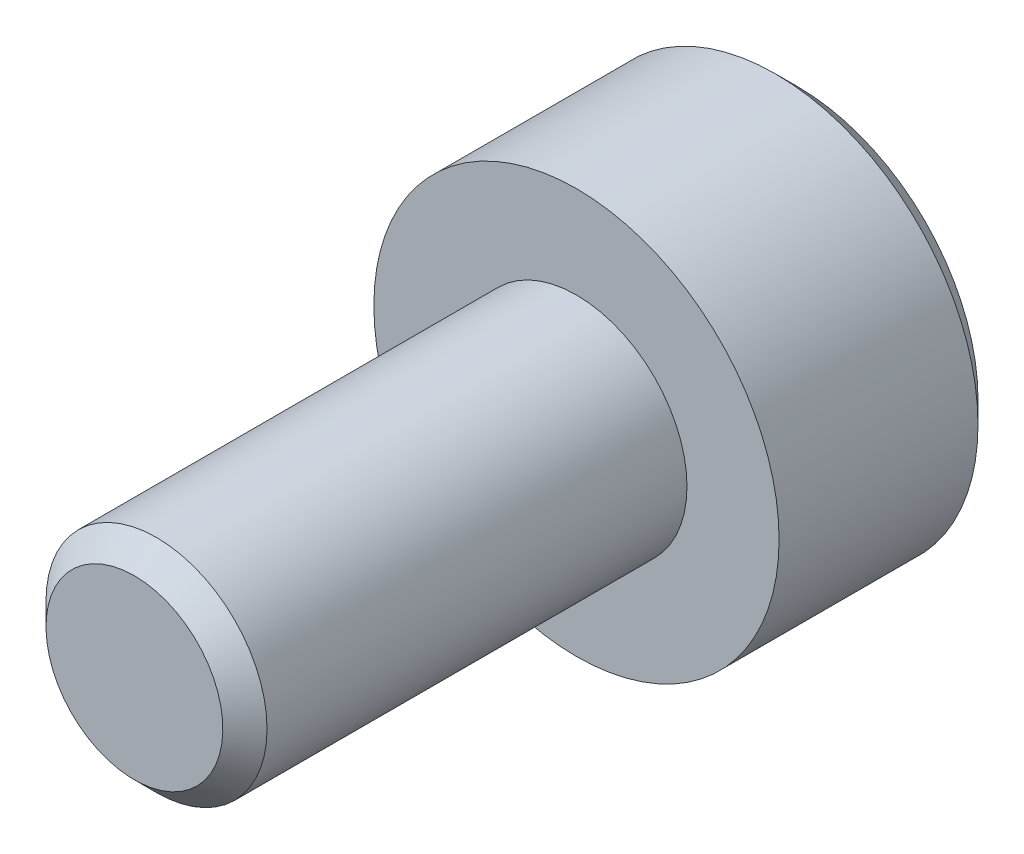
ISO-10303-21;
HEADER;
FILE_DESCRIPTION(('STEP AP214'),'2;1');
FILE_NAME('part.step','',(''),(''),'','','');
FILE_SCHEMA(('AUTOMOTIVE_DESIGN { 1 0 10303 214 1 1 1 1 }'));
ENDSEC;
DATA;
#1=APPLICATION_CONTEXT('core data for automotive mechanical design processes');
#2=APPLICATION_PROTOCOL_DEFINITION('international standard','automotive_design',2000,#1);
#3=PRODUCT_CONTEXT('',#1,'mechanical');
#4=PRODUCT('Part','Part','',(#3));
#5=PRODUCT_RELATED_PRODUCT_CATEGORY('part','',(#4));
#6=PRODUCT_DEFINITION_FORMATION('','',#4);
#7=PRODUCT_DEFINITION_CONTEXT('part definition',#1,'design');
#8=PRODUCT_DEFINITION('design','',#6,#7);
#9=PRODUCT_DEFINITION_SHAPE('','',#8);
#10=(LENGTH_UNIT() NAMED_UNIT(*) SI_UNIT(.MILLI.,.METRE.));
#11=(NAMED_UNIT(*) PLANE_ANGLE_UNIT() SI_UNIT($,.RADIAN.));
#12=(NAMED_UNIT(*) SI_UNIT($,.STERADIAN.) SOLID_ANGLE_UNIT());
#13=UNCERTAINTY_MEASURE_WITH_UNIT(LENGTH_MEASURE(1.E-05),#10,'distance_accuracy_value','');
#14=(GEOMETRIC_REPRESENTATION_CONTEXT(3) GLOBAL_UNCERTAINTY_ASSIGNED_CONTEXT((#13)) GLOBAL_UNIT_ASSIGNED_CONTEXT((#10,
#11,#12)) REPRESENTATION_CONTEXT('',''));
#15=CARTESIAN_POINT('',(0.,0.,0.));
#16=DIRECTION('',(0.,0.,1.));
#17=DIRECTION('',(1.,0.,0.));
#18=AXIS2_PLACEMENT_3D('',#15,#16,#17);
#19=CARTESIAN_POINT('',(2.548,2.548,-3.));
#20=DIRECTION('',(0.,0.,-1.));
#21=DIRECTION('',(0.,-1.,0.));
#22=AXIS2_PLACEMENT_3D('',#19,#20,#21);
#23=PLANE('',#22);
#24=CARTESIAN_POINT('',(1.26031915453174E-13,0.,-2.99999999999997));
#25=DIRECTION('',(0.,0.,1.));
#26=DIRECTION('',(0.,-1.,0.));
#27=AXIS2_PLACEMENT_3D('',#24,#25,#26);
#28=CIRCLE('',#27,2.45000000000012);
#29=CARTESIAN_POINT('',(1.26031915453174E-13,-2.45000000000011,-2.99999999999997));
#30=VERTEX_POINT('',#29);
#31=EDGE_CURVE('E18',#30,#30,#28,.T.);
#32=ORIENTED_EDGE('',*,*,#31,.F.);
#33=EDGE_LOOP('',(#32));
#34=FACE_BOUND('',#33,.T.);
#35=ADVANCED_FACE('F14',(#34),#23,.T.);
#36=CARTESIAN_POINT('',(1.2610626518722E-13,0.,-2.689904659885));
#37=DIRECTION('',(0.,0.,1.));
#38=DIRECTION('',(0.,-1.,0.));
#39=AXIS2_PLACEMENT_3D('',#36,#37,#38);
#40=CONICAL_SURFACE('',#39,2.76009534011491,0.785398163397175);
#41=ORIENTED_EDGE('',*,*,#31,.T.);
#42=EDGE_LOOP('',(#41));
#43=FACE_BOUND('',#42,.T.);
#44=CARTESIAN_POINT('',(-4.4354710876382E-13,0.,-2.7));
#45=DIRECTION('',(0.,0.,1.));
#46=DIRECTION('',(1.,0.,0.));
#47=AXIS2_PLACEMENT_3D('',#44,#45,#46);
#48=CIRCLE('',#47,2.75000000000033);
#49=CARTESIAN_POINT('',(2.74999999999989,0.,-2.7));
#50=VERTEX_POINT('',#49);
#51=EDGE_CURVE('E34',#50,#50,#48,.T.);
#52=ORIENTED_EDGE('',*,*,#51,.F.);
#53=EDGE_LOOP('',(#52));
#54=FACE_BOUND('',#53,.T.);
#55=ADVANCED_FACE('F50',(#43,#54),#40,.T.);
#56=CARTESIAN_POINT('',(1.249552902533,1.248,6.));
#57=DIRECTION('',(0.,0.,-1.));
#58=DIRECTION('',(0.,-1.,0.));
#59=AXIS2_PLACEMENT_3D('',#56,#57,#58);
#60=PLANE('',#59);
#61=CARTESIAN_POINT('',(5.35173421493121E-13,0.,5.99999999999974));
#62=DIRECTION('',(0.,0.,-1.));
#63=DIRECTION('',(0.,1.,0.));
#64=AXIS2_PLACEMENT_3D('',#61,#62,#63);
#65=CIRCLE('',#64,1.20000000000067);
#66=CARTESIAN_POINT('',(5.35173421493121E-13,1.20000000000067,5.99999999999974));
#67=VERTEX_POINT('',#66);
#68=EDGE_CURVE('E37',#67,#67,#65,.T.);
#69=ORIENTED_EDGE('',*,*,#68,.F.);
#70=EDGE_LOOP('',(#69));
#71=FACE_BOUND('',#70,.T.);
#72=ADVANCED_FACE('F59',(#71),#60,.F.);
#73=CARTESIAN_POINT('',(-4.4354710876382E-13,0.,0.054));
#74=DIRECTION('',(0.,0.,-1.));
#75=DIRECTION('',(0.,1.,0.));
#76=AXIS2_PLACEMENT_3D('',#73,#74,#75);
#77=CYLINDRICAL_SURFACE('',#76,2.75000000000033);
#78=ORIENTED_EDGE('',*,*,#51,.T.);
#79=EDGE_LOOP('',(#78));
#80=FACE_BOUND('',#79,.T.);
#81=CARTESIAN_POINT('',(-4.43546905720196E-13,0.,0.));
#82=DIRECTION('',(0.,0.,-1.));
#83=DIRECTION('',(0.,1.,0.));
#84=AXIS2_PLACEMENT_3D('',#81,#82,#83);
#85=CIRCLE('',#84,2.75000000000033);
#86=CARTESIAN_POINT('',(-4.43546905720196E-13,2.75000000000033,0.));
#87=VERTEX_POINT('',#86);
#88=EDGE_CURVE('E30',#87,#87,#85,.T.);
#89=ORIENTED_EDGE('',*,*,#88,.T.);
#90=EDGE_LOOP('',(#89));
#91=FACE_BOUND('',#90,.T.);
#92=ADVANCED_FACE('F72',(#80,#91),#77,.T.);
#93=CARTESIAN_POINT('',(5.35162192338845E-13,0.,6.010095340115));
#94=DIRECTION('',(0.,0.,-1.));
#95=DIRECTION('',(0.,1.,0.));
#96=AXIS2_PLACEMENT_3D('',#93,#94,#95);
#97=CONICAL_SURFACE('',#96,1.18990465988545,0.785398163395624);
#98=CARTESIAN_POINT('',(1.55948929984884E-13,0.,5.7));
#99=DIRECTION('',(0.,0.,-1.));
#100=DIRECTION('',(-1.,0.,0.));
#101=AXIS2_PLACEMENT_3D('',#98,#99,#100);
#102=CIRCLE('',#101,1.49999999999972);
#103=CARTESIAN_POINT('',(-1.49999999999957,0.,5.7));
#104=VERTEX_POINT('',#103);
#105=EDGE_CURVE('E23',#104,#104,#102,.T.);
#106=ORIENTED_EDGE('',*,*,#105,.F.);
#107=EDGE_LOOP('',(#106));
#108=FACE_BOUND('',#107,.T.);
#109=ORIENTED_EDGE('',*,*,#68,.T.);
#110=EDGE_LOOP('',(#109));
#111=FACE_BOUND('',#110,.T.);
#112=ADVANCED_FACE('F66',(#108,#111),#97,.T.);
#113=CARTESIAN_POINT('',(2.862355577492,2.86,0.));
#114=DIRECTION('',(0.,0.,-1.));
#115=DIRECTION('',(0.,-1.,0.));
#116=AXIS2_PLACEMENT_3D('',#113,#114,#115);
#117=PLANE('',#116);
#118=CARTESIAN_POINT('',(1.61078985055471E-13,0.,0.));
#119=DIRECTION('',(0.,0.,-1.));
#120=DIRECTION('',(0.,1.,0.));
#121=AXIS2_PLACEMENT_3D('',#118,#119,#120);
#122=CIRCLE('',#121,1.49999999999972);
#123=CARTESIAN_POINT('',(1.61078985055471E-13,1.49999999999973,0.));
#124=VERTEX_POINT('',#123);
#125=EDGE_CURVE('E10',#124,#124,#122,.F.);
#126=ORIENTED_EDGE('',*,*,#125,.F.);
#127=EDGE_LOOP('',(#126));
#128=FACE_BOUND('',#127,.T.);
#129=ORIENTED_EDGE('',*,*,#88,.F.);
#130=EDGE_LOOP('',(#129));
#131=FACE_BOUND('',#130,.T.);
#132=ADVANCED_FACE('F62',(#128,#131),#117,.F.);
#133=CARTESIAN_POINT('',(1.55948929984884E-13,0.,5.814));
#134=DIRECTION('',(0.,0.,-1.));
#135=DIRECTION('',(0.,1.,0.));
#136=AXIS2_PLACEMENT_3D('',#133,#134,#135);
#137=CYLINDRICAL_SURFACE('',#136,1.49999999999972);
#138=ORIENTED_EDGE('',*,*,#125,.T.);
#139=EDGE_LOOP('',(#138));
#140=FACE_BOUND('',#139,.T.);
#141=ORIENTED_EDGE('',*,*,#105,.T.);
#142=EDGE_LOOP('',(#141));
#143=FACE_BOUND('',#142,.T.);
#144=ADVANCED_FACE('F16',(#140,#143),#137,.T.);
#145=CLOSED_SHELL('',(#35,#55,#72,#92,#112,#132,#144));
#146=MANIFOLD_SOLID_BREP('B1',#145);
#147=ADVANCED_BREP_SHAPE_REPRESENTATION('',(#18,#146),#14);
#148=SHAPE_DEFINITION_REPRESENTATION(#9,#147);
ENDSEC;
END-ISO-10303-21;
